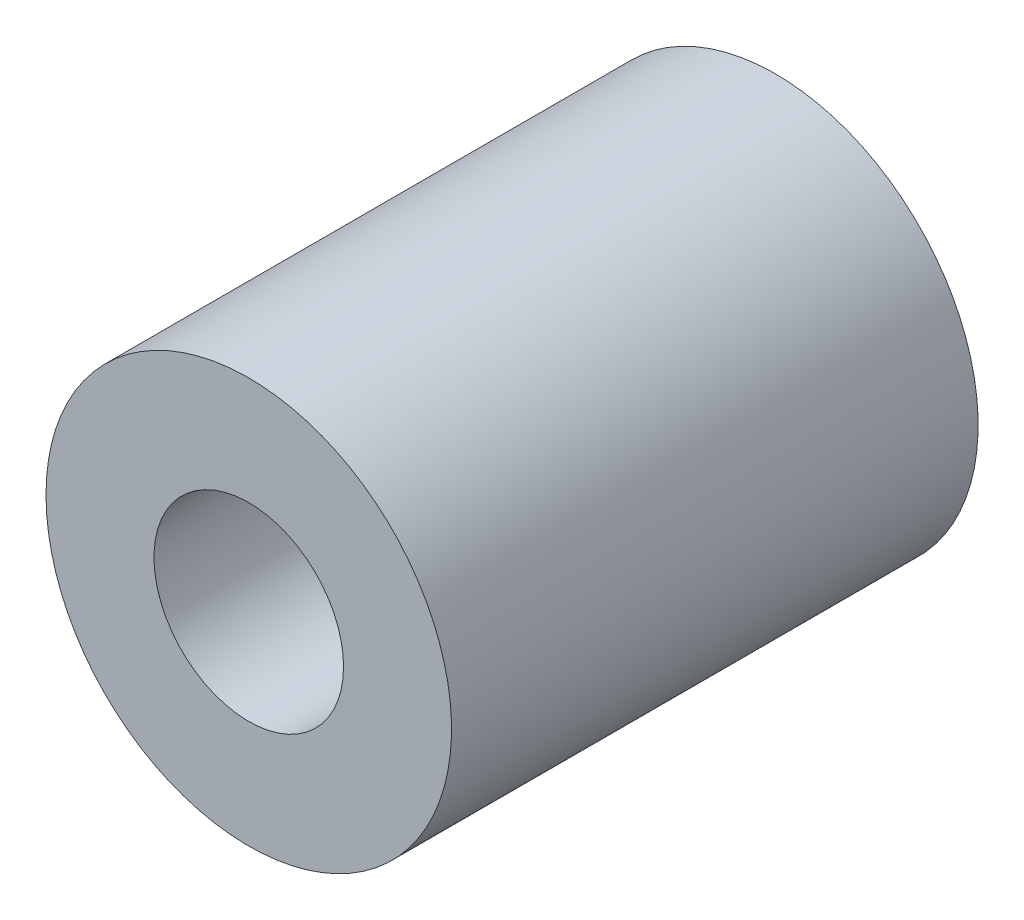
ISO-10303-21;
HEADER;
FILE_DESCRIPTION(('STEP AP214'),'2;1');
FILE_NAME('part.step','',(''),(''),'','','');
FILE_SCHEMA(('AUTOMOTIVE_DESIGN { 1 0 10303 214 1 1 1 1 }'));
ENDSEC;
DATA;
#1=APPLICATION_CONTEXT('core data for automotive mechanical design processes');
#2=APPLICATION_PROTOCOL_DEFINITION('international standard','automotive_design',2000,#1);
#3=PRODUCT_CONTEXT('',#1,'mechanical');
#4=PRODUCT('Part','Part','',(#3));
#5=PRODUCT_RELATED_PRODUCT_CATEGORY('part','',(#4));
#6=PRODUCT_DEFINITION_FORMATION('','',#4);
#7=PRODUCT_DEFINITION_CONTEXT('part definition',#1,'design');
#8=PRODUCT_DEFINITION('design','',#6,#7);
#9=PRODUCT_DEFINITION_SHAPE('','',#8);
#10=(LENGTH_UNIT() NAMED_UNIT(*) SI_UNIT(.MILLI.,.METRE.));
#11=(NAMED_UNIT(*) PLANE_ANGLE_UNIT() SI_UNIT($,.RADIAN.));
#12=(NAMED_UNIT(*) SI_UNIT($,.STERADIAN.) SOLID_ANGLE_UNIT());
#13=UNCERTAINTY_MEASURE_WITH_UNIT(LENGTH_MEASURE(1.E-05),#10,'distance_accuracy_value','');
#14=(GEOMETRIC_REPRESENTATION_CONTEXT(3) GLOBAL_UNCERTAINTY_ASSIGNED_CONTEXT((#13)) GLOBAL_UNIT_ASSIGNED_CONTEXT((#10,
#11,#12)) REPRESENTATION_CONTEXT('',''));
#15=CARTESIAN_POINT('',(0.,0.,0.));
#16=DIRECTION('',(0.,0.,1.));
#17=DIRECTION('',(1.,0.,0.));
#18=AXIS2_PLACEMENT_3D('',#15,#16,#17);
#19=CARTESIAN_POINT('',(0.,0.,25.4));
#20=DIRECTION('',(0.,0.,-1.));
#21=DIRECTION('',(-1.,0.,0.));
#22=AXIS2_PLACEMENT_3D('',#19,#20,#21);
#23=CYLINDRICAL_SURFACE('',#22,9.779);
#24=CARTESIAN_POINT('',(0.,0.,25.4));
#25=DIRECTION('',(0.,0.,1.));
#26=DIRECTION('',(1.,0.,0.));
#27=AXIS2_PLACEMENT_3D('',#24,#25,#26);
#28=CIRCLE('',#27,9.779);
#29=CARTESIAN_POINT('',(-9.779,0.,25.4));
#30=VERTEX_POINT('',#29);
#31=EDGE_CURVE('E10',#30,#30,#28,.T.);
#32=CARTESIAN_POINT('',(0.,0.,0.));
#33=DIRECTION('',(0.,0.,1.));
#34=DIRECTION('',(1.,0.,0.));
#35=AXIS2_PLACEMENT_3D('',#32,#33,#34);
#36=CIRCLE('',#35,9.779);
#37=CARTESIAN_POINT('',(-9.779,0.,0.));
#38=VERTEX_POINT('',#37);
#39=EDGE_CURVE('E39',#38,#38,#36,.T.);
#40=CARTESIAN_POINT('',(-9.779,0.,25.4));
#41=CARTESIAN_POINT('',(-9.779,0.,25.1354166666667));
#42=CARTESIAN_POINT('',(-9.779,0.,24.8708333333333));
#43=CARTESIAN_POINT('',(-9.779,0.,24.3416666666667));
#44=CARTESIAN_POINT('',(-9.779,0.,24.0770833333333));
#45=CARTESIAN_POINT('',(-9.779,0.,23.5479166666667));
#46=CARTESIAN_POINT('',(-9.779,0.,23.2833333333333));
#47=CARTESIAN_POINT('',(-9.779,0.,22.7541666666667));
#48=CARTESIAN_POINT('',(-9.779,0.,22.4895833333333));
#49=CARTESIAN_POINT('',(-9.779,0.,21.9604166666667));
#50=CARTESIAN_POINT('',(-9.779,0.,21.6958333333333));
#51=CARTESIAN_POINT('',(-9.779,0.,21.1666666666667));
#52=CARTESIAN_POINT('',(-9.779,0.,20.9020833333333));
#53=CARTESIAN_POINT('',(-9.779,0.,20.3729166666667));
#54=CARTESIAN_POINT('',(-9.779,0.,20.1083333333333));
#55=CARTESIAN_POINT('',(-9.779,0.,19.5791666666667));
#56=CARTESIAN_POINT('',(-9.779,0.,19.3145833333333));
#57=CARTESIAN_POINT('',(-9.779,0.,18.7854166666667));
#58=CARTESIAN_POINT('',(-9.779,0.,18.5208333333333));
#59=CARTESIAN_POINT('',(-9.779,0.,17.9916666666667));
#60=CARTESIAN_POINT('',(-9.779,0.,17.7270833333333));
#61=CARTESIAN_POINT('',(-9.779,0.,17.1979166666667));
#62=CARTESIAN_POINT('',(-9.779,0.,16.9333333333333));
#63=CARTESIAN_POINT('',(-9.779,0.,16.4041666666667));
#64=CARTESIAN_POINT('',(-9.779,0.,16.1395833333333));
#65=CARTESIAN_POINT('',(-9.779,0.,15.6104166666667));
#66=CARTESIAN_POINT('',(-9.779,0.,15.3458333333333));
#67=CARTESIAN_POINT('',(-9.779,0.,14.8166666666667));
#68=CARTESIAN_POINT('',(-9.779,0.,14.5520833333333));
#69=CARTESIAN_POINT('',(-9.779,0.,14.0229166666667));
#70=CARTESIAN_POINT('',(-9.779,0.,13.7583333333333));
#71=CARTESIAN_POINT('',(-9.779,0.,13.2291666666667));
#72=CARTESIAN_POINT('',(-9.779,0.,12.9645833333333));
#73=CARTESIAN_POINT('',(-9.779,0.,12.4354166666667));
#74=CARTESIAN_POINT('',(-9.779,0.,12.1708333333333));
#75=CARTESIAN_POINT('',(-9.779,0.,11.6416666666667));
#76=CARTESIAN_POINT('',(-9.779,0.,11.3770833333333));
#77=CARTESIAN_POINT('',(-9.779,0.,10.8479166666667));
#78=CARTESIAN_POINT('',(-9.779,0.,10.5833333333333));
#79=CARTESIAN_POINT('',(-9.779,0.,10.0541666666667));
#80=CARTESIAN_POINT('',(-9.779,0.,9.78958333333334));
#81=CARTESIAN_POINT('',(-9.779,0.,9.26041666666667));
#82=CARTESIAN_POINT('',(-9.779,0.,8.99583333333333));
#83=CARTESIAN_POINT('',(-9.779,0.,8.46666666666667));
#84=CARTESIAN_POINT('',(-9.779,0.,8.20208333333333));
#85=CARTESIAN_POINT('',(-9.779,0.,7.67291666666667));
#86=CARTESIAN_POINT('',(-9.779,0.,7.40833333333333));
#87=CARTESIAN_POINT('',(-9.779,0.,6.87916666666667));
#88=CARTESIAN_POINT('',(-9.779,0.,6.61458333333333));
#89=CARTESIAN_POINT('',(-9.779,0.,6.08541666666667));
#90=CARTESIAN_POINT('',(-9.779,0.,5.82083333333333));
#91=CARTESIAN_POINT('',(-9.779,0.,5.29166666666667));
#92=CARTESIAN_POINT('',(-9.779,0.,5.02708333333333));
#93=CARTESIAN_POINT('',(-9.779,0.,4.49791666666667));
#94=CARTESIAN_POINT('',(-9.779,0.,4.23333333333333));
#95=CARTESIAN_POINT('',(-9.779,0.,3.70416666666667));
#96=CARTESIAN_POINT('',(-9.779,0.,3.43958333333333));
#97=CARTESIAN_POINT('',(-9.779,0.,2.91041666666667));
#98=CARTESIAN_POINT('',(-9.779,0.,2.64583333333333));
#99=CARTESIAN_POINT('',(-9.779,0.,2.11666666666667));
#100=CARTESIAN_POINT('',(-9.779,0.,1.85208333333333));
#101=CARTESIAN_POINT('',(-9.779,0.,1.32291666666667));
#102=CARTESIAN_POINT('',(-9.779,0.,1.05833333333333));
#103=CARTESIAN_POINT('',(-9.779,0.,0.529166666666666));
#104=CARTESIAN_POINT('',(-9.779,0.,0.264583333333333));
#105=CARTESIAN_POINT('',(-9.779,0.,0.));
#106=B_SPLINE_CURVE_WITH_KNOTS('',3,(#40,#41,#42,#43,#44,#45,#46,#47,#48,#49,#50,#51,#52,#53,
#54,#55,#56,#57,#58,#59,#60,#61,#62,#63,#64,#65,#66,#67,#68,#69,#70,#71,#72,#73,#74,#75,#76,#77,
#78,#79,#80,#81,#82,#83,#84,#85,#86,#87,#88,#89,#90,#91,#92,#93,#94,#95,#96,#97,#98,#99,#100,
#101,#102,#103,#104,#105),.UNSPECIFIED.,.F.,.F.,(4,2,2,2,2,2,2,2,2,2,2,2,2,2,2,2,2,2,2,2,2,2,2,
2,2,2,2,2,2,2,2,2,4),(0.,0.793749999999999,1.5875,2.38125,3.175,3.96875,4.7625,5.55625,6.35,
7.14375,7.9375,8.73125,9.525,10.31875,11.1125,11.90625,12.7,13.49375,14.2875,15.08125,15.875,
16.66875,17.4625,18.25625,19.05,19.84375,20.6375,21.43125,22.225,23.01875,23.8125,24.60625,
25.4),.UNSPECIFIED.);
#107=EDGE_CURVE('BSEAM36',#30,#38,#106,.T.);
#108=ORIENTED_EDGE('',*,*,#31,.F.);
#109=ORIENTED_EDGE('',*,*,#39,.T.);
#110=ORIENTED_EDGE('',*,*,#107,.T.);
#111=ORIENTED_EDGE('',*,*,#107,.F.);
#112=EDGE_LOOP('',(#108,#110,#109,#111));
#113=FACE_BOUND('',#112,.T.);
#114=ADVANCED_FACE('F36',(#113),#23,.T.);
#115=CARTESIAN_POINT('',(0.,0.,25.4));
#116=DIRECTION('',(0.,0.,1.));
#117=DIRECTION('',(1.,0.,0.));
#118=AXIS2_PLACEMENT_3D('',#115,#116,#117);
#119=PLANE('',#118);
#120=CARTESIAN_POINT('',(0.,0.,25.4));
#121=DIRECTION('',(0.,0.,1.));
#122=DIRECTION('',(1.,0.,0.));
#123=AXIS2_PLACEMENT_3D('',#120,#121,#122);
#124=CIRCLE('',#123,4.572);
#125=CARTESIAN_POINT('',(4.572,0.,25.4));
#126=VERTEX_POINT('',#125);
#127=EDGE_CURVE('E54',#126,#126,#124,.T.);
#128=ORIENTED_EDGE('',*,*,#127,.F.);
#129=EDGE_LOOP('',(#128));
#130=FACE_BOUND('',#129,.T.);
#131=ORIENTED_EDGE('',*,*,#31,.T.);
#132=EDGE_LOOP('',(#131));
#133=FACE_BOUND('',#132,.T.);
#134=ADVANCED_FACE('F69',(#130,#133),#119,.T.);
#135=CARTESIAN_POINT('',(0.,0.,0.));
#136=DIRECTION('',(0.,0.,1.));
#137=DIRECTION('',(1.,0.,0.));
#138=AXIS2_PLACEMENT_3D('',#135,#136,#137);
#139=PLANE('',#138);
#140=CARTESIAN_POINT('',(0.,0.,0.));
#141=DIRECTION('',(0.,0.,-1.));
#142=DIRECTION('',(-1.,0.,0.));
#143=AXIS2_PLACEMENT_3D('',#140,#141,#142);
#144=CIRCLE('',#143,4.5339);
#145=CARTESIAN_POINT('',(-4.5339,0.,0.));
#146=VERTEX_POINT('',#145);
#147=EDGE_CURVE('E48',#146,#146,#144,.T.);
#148=ORIENTED_EDGE('',*,*,#147,.F.);
#149=EDGE_LOOP('',(#148));
#150=FACE_BOUND('',#149,.T.);
#151=ORIENTED_EDGE('',*,*,#39,.F.);
#152=EDGE_LOOP('',(#151));
#153=FACE_BOUND('',#152,.T.);
#154=ADVANCED_FACE('F71',(#150,#153),#139,.F.);
#155=CARTESIAN_POINT('',(0.,0.,9.144));
#156=DIRECTION('',(0.,0.,-1.));
#157=DIRECTION('',(-1.,0.,0.));
#158=AXIS2_PLACEMENT_3D('',#155,#156,#157);
#159=CYLINDRICAL_SURFACE('',#158,4.5339);
#160=CARTESIAN_POINT('',(0.,0.,9.144));
#161=DIRECTION('',(0.,0.,-1.));
#162=DIRECTION('',(-1.,0.,0.));
#163=AXIS2_PLACEMENT_3D('',#160,#161,#162);
#164=CIRCLE('',#163,4.5339);
#165=CARTESIAN_POINT('',(-4.5339,0.,9.144));
#166=VERTEX_POINT('',#165);
#167=EDGE_CURVE('E46',#166,#166,#164,.T.);
#168=ORIENTED_EDGE('',*,*,#167,.F.);
#169=EDGE_LOOP('',(#168));
#170=FACE_BOUND('',#169,.T.);
#171=ORIENTED_EDGE('',*,*,#147,.T.);
#172=EDGE_LOOP('',(#171));
#173=FACE_BOUND('',#172,.T.);
#174=ADVANCED_FACE('F77',(#170,#173),#159,.F.);
#175=CARTESIAN_POINT('',(0.,0.,9.144));
#176=DIRECTION('',(0.,0.,-1.));
#177=DIRECTION('',(-1.,0.,0.));
#178=AXIS2_PLACEMENT_3D('',#175,#176,#177);
#179=PLANE('',#178);
#180=ORIENTED_EDGE('',*,*,#167,.T.);
#181=EDGE_LOOP('',(#180));
#182=FACE_BOUND('',#181,.T.);
#183=ADVANCED_FACE('F65',(#182),#179,.T.);
#184=CARTESIAN_POINT('',(0.,0.,16.256));
#185=DIRECTION('',(0.,0.,1.));
#186=DIRECTION('',(1.,0.,0.));
#187=AXIS2_PLACEMENT_3D('',#184,#185,#186);
#188=CYLINDRICAL_SURFACE('',#187,4.572);
#189=CARTESIAN_POINT('',(0.,0.,16.256));
#190=DIRECTION('',(0.,0.,1.));
#191=DIRECTION('',(1.,0.,0.));
#192=AXIS2_PLACEMENT_3D('',#189,#190,#191);
#193=CIRCLE('',#192,4.572);
#194=CARTESIAN_POINT('',(4.572,0.,16.256));
#195=VERTEX_POINT('',#194);
#196=EDGE_CURVE('E51',#195,#195,#193,.T.);
#197=ORIENTED_EDGE('',*,*,#196,.F.);
#198=EDGE_LOOP('',(#197));
#199=FACE_BOUND('',#198,.T.);
#200=ORIENTED_EDGE('',*,*,#127,.T.);
#201=EDGE_LOOP('',(#200));
#202=FACE_BOUND('',#201,.T.);
#203=ADVANCED_FACE('F62',(#199,#202),#188,.F.);
#204=CARTESIAN_POINT('',(0.,0.,16.256));
#205=DIRECTION('',(0.,0.,1.));
#206=DIRECTION('',(1.,0.,0.));
#207=AXIS2_PLACEMENT_3D('',#204,#205,#206);
#208=PLANE('',#207);
#209=ORIENTED_EDGE('',*,*,#196,.T.);
#210=EDGE_LOOP('',(#209));
#211=FACE_BOUND('',#210,.T.);
#212=ADVANCED_FACE('F60',(#211),#208,.T.);
#213=CLOSED_SHELL('',(#114,#134,#154,#174,#183,#203,#212));
#214=MANIFOLD_SOLID_BREP('B2',#213);
#215=ADVANCED_BREP_SHAPE_REPRESENTATION('',(#18,#214),#14);
#216=SHAPE_DEFINITION_REPRESENTATION(#9,#215);
ENDSEC;
END-ISO-10303-21;
